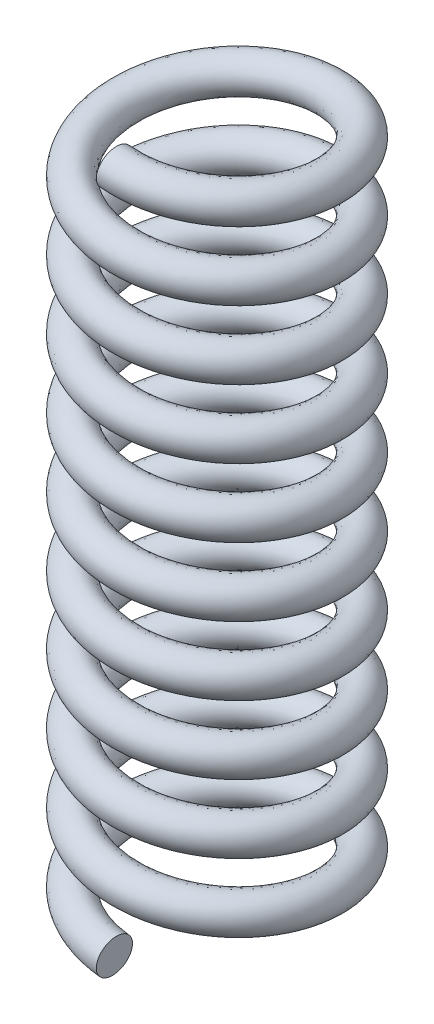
from build123d import *

# Parameters (mm, degrees)
SWEEP1_PITCH  = 19
SWEEP1_HEIGHT = 190
SWEEP1_RADIUS = 28.5
SKETCH3_R     = 5


with BuildPart() as part:
    # Sweep1: sweep along a helix
    with BuildLine() as sweep1_path:
        Helix(SWEEP1_PITCH, SWEEP1_HEIGHT, SWEEP1_RADIUS, center=(0, 0, 0), direction=(0, 1, 0), lefthand=True)
    # Sketch3 → Sweep1 (sweep)
    with BuildSketch(Plane(origin=(0, 0, 28.5), x_dir=(0, 0, 1), z_dir=(-0.9944181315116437, 0.1055110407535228, 0))):
        Circle(SKETCH3_R)
    sweep(path=sweep1_path.line, is_frenet=True)


solid = part.part
